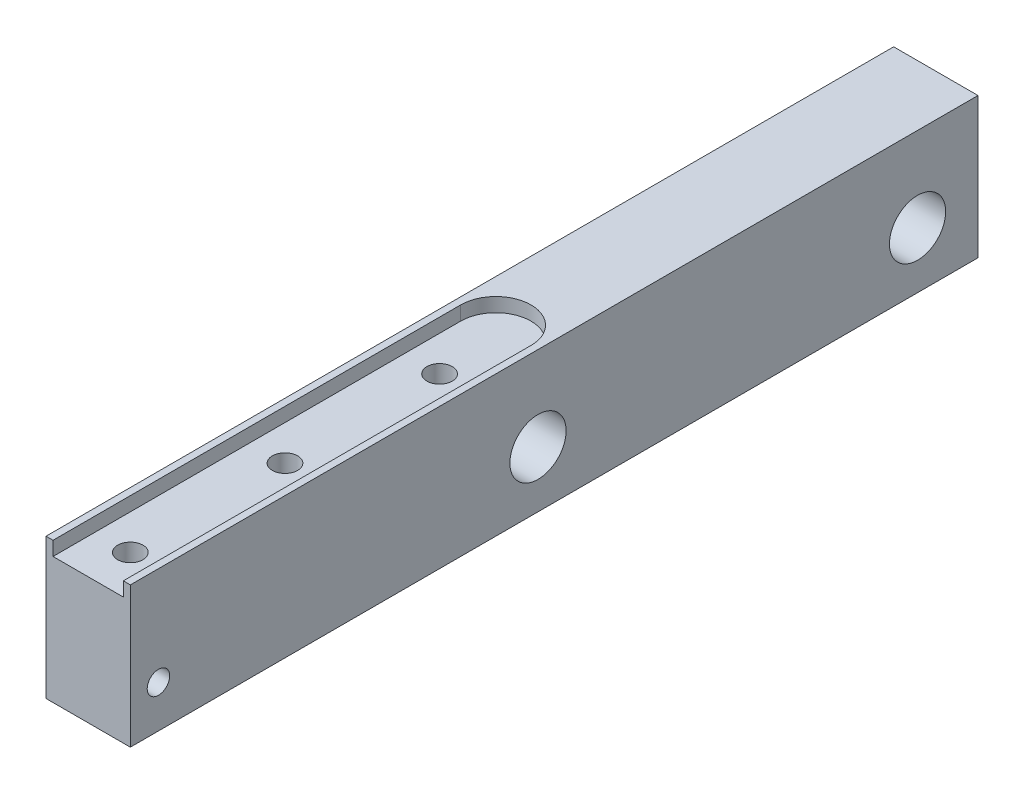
ISO-10303-21;
HEADER;
FILE_DESCRIPTION(('STEP AP214'),'2;1');
FILE_NAME('part.step','',(''),(''),'','','');
FILE_SCHEMA(('AUTOMOTIVE_DESIGN { 1 0 10303 214 1 1 1 1 }'));
ENDSEC;
DATA;
#1=APPLICATION_CONTEXT('core data for automotive mechanical design processes');
#2=APPLICATION_PROTOCOL_DEFINITION('international standard','automotive_design',2000,#1);
#3=PRODUCT_CONTEXT('',#1,'mechanical');
#4=PRODUCT('Part','Part','',(#3));
#5=PRODUCT_RELATED_PRODUCT_CATEGORY('part','',(#4));
#6=PRODUCT_DEFINITION_FORMATION('','',#4);
#7=PRODUCT_DEFINITION_CONTEXT('part definition',#1,'design');
#8=PRODUCT_DEFINITION('design','',#6,#7);
#9=PRODUCT_DEFINITION_SHAPE('','',#8);
#10=(LENGTH_UNIT() NAMED_UNIT(*) SI_UNIT(.MILLI.,.METRE.));
#11=(NAMED_UNIT(*) PLANE_ANGLE_UNIT() SI_UNIT($,.RADIAN.));
#12=(NAMED_UNIT(*) SI_UNIT($,.STERADIAN.) SOLID_ANGLE_UNIT());
#13=UNCERTAINTY_MEASURE_WITH_UNIT(LENGTH_MEASURE(1.E-05),#10,'distance_accuracy_value','');
#14=(GEOMETRIC_REPRESENTATION_CONTEXT(3) GLOBAL_UNCERTAINTY_ASSIGNED_CONTEXT((#13)) GLOBAL_UNIT_ASSIGNED_CONTEXT((#10,
#11,#12)) REPRESENTATION_CONTEXT('',''));
#15=CARTESIAN_POINT('',(0.,0.,0.));
#16=DIRECTION('',(0.,0.,1.));
#17=DIRECTION('',(1.,0.,0.));
#18=AXIS2_PLACEMENT_3D('',#15,#16,#17);
#19=CARTESIAN_POINT('',(0.,20.,156.5));
#20=DIRECTION('',(0.,1.,0.));
#21=DIRECTION('',(0.,0.,1.));
#22=AXIS2_PLACEMENT_3D('',#19,#20,#21);
#23=PLANE('',#22);
#24=CARTESIAN_POINT('',(0.,20.,231.5));
#25=DIRECTION('',(0.,1.,0.));
#26=DIRECTION('',(0.,0.,1.));
#27=AXIS2_PLACEMENT_3D('',#24,#25,#26);
#28=CIRCLE('',#27,4.49999999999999);
#29=CARTESIAN_POINT('',(0.,20.,236.));
#30=VERTEX_POINT('',#29);
#31=EDGE_CURVE('E135',#30,#30,#28,.F.);
#32=ORIENTED_EDGE('',*,*,#31,.T.);
#33=EDGE_LOOP('',(#32));
#34=FACE_BOUND('',#33,.T.);
#35=DIRECTION('',(0.,0.,1.));
#36=VECTOR('',#35,1.);
#37=CARTESIAN_POINT('',(-12.5,20.,301.5));
#38=LINE('',#37,#36);
#39=CARTESIAN_POINT('',(-12.5,20.,156.5));
#40=VERTEX_POINT('',#39);
#41=CARTESIAN_POINT('',(-12.5,20.,301.5));
#42=VERTEX_POINT('',#41);
#43=EDGE_CURVE('E45',#40,#42,#38,.T.);
#44=ORIENTED_EDGE('',*,*,#43,.T.);
#45=DIRECTION('',(1.,0.,0.));
#46=VECTOR('',#45,1.);
#47=CARTESIAN_POINT('',(-12.5,20.,301.5));
#48=LINE('',#47,#46);
#49=CARTESIAN_POINT('',(12.5,20.,301.5));
#50=VERTEX_POINT('',#49);
#51=EDGE_CURVE('E155',#42,#50,#48,.T.);
#52=ORIENTED_EDGE('',*,*,#51,.T.);
#53=DIRECTION('',(0.,0.,-1.));
#54=VECTOR('',#53,1.);
#55=CARTESIAN_POINT('',(12.5,20.,301.5));
#56=LINE('',#55,#54);
#57=CARTESIAN_POINT('',(12.5,20.,156.5));
#58=VERTEX_POINT('',#57);
#59=EDGE_CURVE('E157',#50,#58,#56,.T.);
#60=ORIENTED_EDGE('',*,*,#59,.T.);
#61=CARTESIAN_POINT('',(0.,20.,156.5));
#62=DIRECTION('',(0.,1.,0.));
#63=DIRECTION('',(0.,0.,1.));
#64=AXIS2_PLACEMENT_3D('',#61,#62,#63);
#65=CIRCLE('',#64,12.5);
#66=EDGE_CURVE('E160',#58,#40,#65,.T.);
#67=ORIENTED_EDGE('',*,*,#66,.T.);
#68=EDGE_LOOP('',(#44,#52,#60,#67));
#69=FACE_BOUND('',#68,.T.);
#70=CARTESIAN_POINT('',(0.,20.,176.5));
#71=DIRECTION('',(0.,1.,0.));
#72=DIRECTION('',(0.,0.,1.));
#73=AXIS2_PLACEMENT_3D('',#70,#71,#72);
#74=CIRCLE('',#73,4.49999999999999);
#75=CARTESIAN_POINT('',(0.,20.,181.));
#76=VERTEX_POINT('',#75);
#77=EDGE_CURVE('E139',#76,#76,#74,.F.);
#78=ORIENTED_EDGE('',*,*,#77,.T.);
#79=EDGE_LOOP('',(#78));
#80=FACE_BOUND('',#79,.T.);
#81=CARTESIAN_POINT('',(0.,20.,286.5));
#82=DIRECTION('',(0.,1.,0.));
#83=DIRECTION('',(0.,0.,1.));
#84=AXIS2_PLACEMENT_3D('',#81,#82,#83);
#85=CIRCLE('',#84,4.49999999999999);
#86=CARTESIAN_POINT('',(0.,20.,291.));
#87=VERTEX_POINT('',#86);
#88=EDGE_CURVE('E131',#87,#87,#85,.F.);
#89=ORIENTED_EDGE('',*,*,#88,.T.);
#90=EDGE_LOOP('',(#89));
#91=FACE_BOUND('',#90,.T.);
#92=ADVANCED_FACE('F28',(#34,#69,#80,#91),#23,.T.);
#93=CARTESIAN_POINT('',(-15.,25.,301.5));
#94=DIRECTION('',(1.,0.,0.));
#95=DIRECTION('',(0.,1.,0.));
#96=AXIS2_PLACEMENT_3D('',#93,#94,#95);
#97=PLANE('',#96);
#98=CARTESIAN_POINT('',(-15.,-10.,291.5));
#99=DIRECTION('',(1.,0.,0.));
#100=DIRECTION('',(0.,1.,0.));
#101=AXIS2_PLACEMENT_3D('',#98,#99,#100);
#102=CIRCLE('',#101,3.99999999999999);
#103=CARTESIAN_POINT('',(-15.,-6.00000000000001,291.5));
#104=VERTEX_POINT('',#103);
#105=EDGE_CURVE('E143',#104,#104,#102,.F.);
#106=ORIENTED_EDGE('',*,*,#105,.F.);
#107=EDGE_LOOP('',(#106));
#108=FACE_BOUND('',#107,.T.);
#109=CARTESIAN_POINT('',(-15.,-5.,21.5));
#110=DIRECTION('',(1.,0.,0.));
#111=DIRECTION('',(0.,1.,0.));
#112=AXIS2_PLACEMENT_3D('',#109,#110,#111);
#113=CIRCLE('',#112,10.);
#114=CARTESIAN_POINT('',(-15.,5.,21.5));
#115=VERTEX_POINT('',#114);
#116=EDGE_CURVE('E173',#115,#115,#113,.F.);
#117=ORIENTED_EDGE('',*,*,#116,.F.);
#118=EDGE_LOOP('',(#117));
#119=FACE_BOUND('',#118,.T.);
#120=CARTESIAN_POINT('',(-15.,-5.,156.5));
#121=DIRECTION('',(1.,0.,0.));
#122=DIRECTION('',(0.,1.,0.));
#123=AXIS2_PLACEMENT_3D('',#120,#121,#122);
#124=CIRCLE('',#123,10.);
#125=CARTESIAN_POINT('',(-15.,5.00000000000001,156.5));
#126=VERTEX_POINT('',#125);
#127=EDGE_CURVE('E179',#126,#126,#124,.F.);
#128=ORIENTED_EDGE('',*,*,#127,.F.);
#129=EDGE_LOOP('',(#128));
#130=FACE_BOUND('',#129,.T.);
#131=DIRECTION('',(0.,-1.,0.));
#132=VECTOR('',#131,1.);
#133=CARTESIAN_POINT('',(-15.,25.,0.));
#134=LINE('',#133,#132);
#135=CARTESIAN_POINT('',(-15.,25.,0.));
#136=VERTEX_POINT('',#135);
#137=CARTESIAN_POINT('',(-15.,-25.,0.));
#138=VERTEX_POINT('',#137);
#139=EDGE_CURVE('E182',#136,#138,#134,.T.);
#140=ORIENTED_EDGE('',*,*,#139,.T.);
#141=DIRECTION('',(0.,0.,-1.));
#142=VECTOR('',#141,1.);
#143=CARTESIAN_POINT('',(-15.,-25.,301.5));
#144=LINE('',#143,#142);
#145=CARTESIAN_POINT('',(-15.,-25.,301.5));
#146=VERTEX_POINT('',#145);
#147=EDGE_CURVE('E11',#146,#138,#144,.T.);
#148=ORIENTED_EDGE('',*,*,#147,.F.);
#149=DIRECTION('',(0.,-1.,0.));
#150=VECTOR('',#149,1.);
#151=CARTESIAN_POINT('',(-15.,25.,301.5));
#152=LINE('',#151,#150);
#153=CARTESIAN_POINT('',(-15.,25.,301.5));
#154=VERTEX_POINT('',#153);
#155=EDGE_CURVE('E191',#154,#146,#152,.T.);
#156=ORIENTED_EDGE('',*,*,#155,.F.);
#157=DIRECTION('',(0.,0.,-1.));
#158=VECTOR('',#157,1.);
#159=CARTESIAN_POINT('',(-15.,25.,301.5));
#160=LINE('',#159,#158);
#161=EDGE_CURVE('E200',#154,#136,#160,.T.);
#162=ORIENTED_EDGE('',*,*,#161,.T.);
#163=EDGE_LOOP('',(#140,#148,#156,#162));
#164=FACE_BOUND('',#163,.T.);
#165=ADVANCED_FACE('F30',(#108,#119,#130,#164),#97,.F.);
#166=CARTESIAN_POINT('',(-15.,-25.,301.5));
#167=DIRECTION('',(0.,1.,0.));
#168=DIRECTION('',(0.,0.,1.));
#169=AXIS2_PLACEMENT_3D('',#166,#167,#168);
#170=PLANE('',#169);
#171=CARTESIAN_POINT('',(0.,-25.,201.5));
#172=DIRECTION('',(0.,1.,0.));
#173=DIRECTION('',(0.,0.,1.));
#174=AXIS2_PLACEMENT_3D('',#171,#172,#173);
#175=CIRCLE('',#174,2.50000000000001);
#176=CARTESIAN_POINT('',(0.,-25.,204.));
#177=VERTEX_POINT('',#176);
#178=EDGE_CURVE('E32',#177,#177,#175,.T.);
#179=ORIENTED_EDGE('',*,*,#178,.T.);
#180=EDGE_LOOP('',(#179));
#181=FACE_BOUND('',#180,.T.);
#182=CARTESIAN_POINT('',(0.,-25.,51.5));
#183=DIRECTION('',(0.,1.,0.));
#184=DIRECTION('',(0.,0.,1.));
#185=AXIS2_PLACEMENT_3D('',#182,#183,#184);
#186=CIRCLE('',#185,2.50000000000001);
#187=CARTESIAN_POINT('',(0.,-25.,54.));
#188=VERTEX_POINT('',#187);
#189=EDGE_CURVE('E127',#188,#188,#186,.T.);
#190=ORIENTED_EDGE('',*,*,#189,.T.);
#191=EDGE_LOOP('',(#190));
#192=FACE_BOUND('',#191,.T.);
#193=DIRECTION('',(1.,0.,0.));
#194=VECTOR('',#193,1.);
#195=CARTESIAN_POINT('',(-15.,-25.,0.));
#196=LINE('',#195,#194);
#197=CARTESIAN_POINT('',(15.,-25.,0.));
#198=VERTEX_POINT('',#197);
#199=EDGE_CURVE('E185',#138,#198,#196,.T.);
#200=ORIENTED_EDGE('',*,*,#199,.T.);
#201=DIRECTION('',(0.,0.,-1.));
#202=VECTOR('',#201,1.);
#203=CARTESIAN_POINT('',(15.,-25.,301.5));
#204=LINE('',#203,#202);
#205=CARTESIAN_POINT('',(15.,-25.,301.5));
#206=VERTEX_POINT('',#205);
#207=EDGE_CURVE('E37',#206,#198,#204,.T.);
#208=ORIENTED_EDGE('',*,*,#207,.F.);
#209=DIRECTION('',(1.,0.,0.));
#210=VECTOR('',#209,1.);
#211=CARTESIAN_POINT('',(-15.,-25.,301.5));
#212=LINE('',#211,#210);
#213=EDGE_CURVE('E193',#146,#206,#212,.T.);
#214=ORIENTED_EDGE('',*,*,#213,.F.);
#215=ORIENTED_EDGE('',*,*,#147,.T.);
#216=EDGE_LOOP('',(#200,#208,#214,#215));
#217=FACE_BOUND('',#216,.T.);
#218=ADVANCED_FACE('F216',(#181,#192,#217),#170,.F.);
#219=CARTESIAN_POINT('',(15.,25.,301.5));
#220=DIRECTION('',(-1.,0.,0.));
#221=DIRECTION('',(0.,-1.,0.));
#222=AXIS2_PLACEMENT_3D('',#219,#220,#221);
#223=PLANE('',#222);
#224=CARTESIAN_POINT('',(15.,-10.,291.5));
#225=DIRECTION('',(1.,0.,0.));
#226=DIRECTION('',(0.,1.,0.));
#227=AXIS2_PLACEMENT_3D('',#224,#225,#226);
#228=CIRCLE('',#227,3.99999999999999);
#229=CARTESIAN_POINT('',(15.,-6.00000000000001,291.5));
#230=VERTEX_POINT('',#229);
#231=EDGE_CURVE('E140',#230,#230,#228,.T.);
#232=ORIENTED_EDGE('',*,*,#231,.F.);
#233=EDGE_LOOP('',(#232));
#234=FACE_BOUND('',#233,.T.);
#235=CARTESIAN_POINT('',(15.,-5.,21.5));
#236=DIRECTION('',(1.,0.,0.));
#237=DIRECTION('',(0.,1.,0.));
#238=AXIS2_PLACEMENT_3D('',#235,#236,#237);
#239=CIRCLE('',#238,10.);
#240=CARTESIAN_POINT('',(15.,5.,21.5));
#241=VERTEX_POINT('',#240);
#242=EDGE_CURVE('E165',#241,#241,#239,.T.);
#243=ORIENTED_EDGE('',*,*,#242,.F.);
#244=EDGE_LOOP('',(#243));
#245=FACE_BOUND('',#244,.T.);
#246=CARTESIAN_POINT('',(15.,-5.,156.5));
#247=DIRECTION('',(1.,0.,0.));
#248=DIRECTION('',(0.,1.,0.));
#249=AXIS2_PLACEMENT_3D('',#246,#247,#248);
#250=CIRCLE('',#249,10.);
#251=CARTESIAN_POINT('',(15.,5.00000000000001,156.5));
#252=VERTEX_POINT('',#251);
#253=EDGE_CURVE('E176',#252,#252,#250,.T.);
#254=ORIENTED_EDGE('',*,*,#253,.F.);
#255=EDGE_LOOP('',(#254));
#256=FACE_BOUND('',#255,.T.);
#257=DIRECTION('',(0.,1.,0.));
#258=VECTOR('',#257,1.);
#259=CARTESIAN_POINT('',(15.,25.,0.));
#260=LINE('',#259,#258);
#261=CARTESIAN_POINT('',(15.,25.,0.));
#262=VERTEX_POINT('',#261);
#263=EDGE_CURVE('E187',#198,#262,#260,.T.);
#264=ORIENTED_EDGE('',*,*,#263,.T.);
#265=DIRECTION('',(0.,0.,-1.));
#266=VECTOR('',#265,1.);
#267=CARTESIAN_POINT('',(15.,25.,301.5));
#268=LINE('',#267,#266);
#269=CARTESIAN_POINT('',(15.,25.,301.5));
#270=VERTEX_POINT('',#269);
#271=EDGE_CURVE('E203',#270,#262,#268,.T.);
#272=ORIENTED_EDGE('',*,*,#271,.F.);
#273=DIRECTION('',(0.,1.,0.));
#274=VECTOR('',#273,1.);
#275=CARTESIAN_POINT('',(15.,25.,301.5));
#276=LINE('',#275,#274);
#277=EDGE_CURVE('E195',#206,#270,#276,.T.);
#278=ORIENTED_EDGE('',*,*,#277,.F.);
#279=ORIENTED_EDGE('',*,*,#207,.T.);
#280=EDGE_LOOP('',(#264,#272,#278,#279));
#281=FACE_BOUND('',#280,.T.);
#282=ADVANCED_FACE('F278',(#234,#245,#256,#281),#223,.F.);
#283=CARTESIAN_POINT('',(-15.,25.,301.5));
#284=DIRECTION('',(0.,-1.,0.));
#285=DIRECTION('',(0.,0.,-1.));
#286=AXIS2_PLACEMENT_3D('',#283,#284,#285);
#287=PLANE('',#286);
#288=DIRECTION('',(-1.,0.,0.));
#289=VECTOR('',#288,1.);
#290=CARTESIAN_POINT('',(-15.,25.,301.5));
#291=LINE('',#290,#289);
#292=CARTESIAN_POINT('',(-12.5,25.,301.5));
#293=VERTEX_POINT('',#292);
#294=EDGE_CURVE('E53',#293,#154,#291,.T.);
#295=ORIENTED_EDGE('',*,*,#294,.F.);
#296=DIRECTION('',(0.,0.,1.));
#297=VECTOR('',#296,1.);
#298=CARTESIAN_POINT('',(-12.5,25.,301.5));
#299=LINE('',#298,#297);
#300=CARTESIAN_POINT('',(-12.5,25.,156.5));
#301=VERTEX_POINT('',#300);
#302=EDGE_CURVE('E146',#301,#293,#299,.T.);
#303=ORIENTED_EDGE('',*,*,#302,.F.);
#304=CARTESIAN_POINT('',(0.,25.,156.5));
#305=DIRECTION('',(0.,1.,0.));
#306=DIRECTION('',(0.,0.,1.));
#307=AXIS2_PLACEMENT_3D('',#304,#305,#306);
#308=CIRCLE('',#307,12.5);
#309=CARTESIAN_POINT('',(12.5,25.,156.5));
#310=VERTEX_POINT('',#309);
#311=EDGE_CURVE('E151',#310,#301,#308,.T.);
#312=ORIENTED_EDGE('',*,*,#311,.F.);
#313=DIRECTION('',(0.,0.,-1.));
#314=VECTOR('',#313,1.);
#315=CARTESIAN_POINT('',(12.5,25.,301.5));
#316=LINE('',#315,#314);
#317=CARTESIAN_POINT('',(12.5,25.,301.5));
#318=VERTEX_POINT('',#317);
#319=EDGE_CURVE('E148',#318,#310,#316,.T.);
#320=ORIENTED_EDGE('',*,*,#319,.F.);
#321=EDGE_CURVE('E197',#270,#318,#291,.T.);
#322=ORIENTED_EDGE('',*,*,#321,.F.);
#323=ORIENTED_EDGE('',*,*,#271,.T.);
#324=DIRECTION('',(-1.,0.,0.));
#325=VECTOR('',#324,1.);
#326=CARTESIAN_POINT('',(-15.,25.,0.));
#327=LINE('',#326,#325);
#328=EDGE_CURVE('E189',#262,#136,#327,.T.);
#329=ORIENTED_EDGE('',*,*,#328,.T.);
#330=ORIENTED_EDGE('',*,*,#161,.F.);
#331=EDGE_LOOP('',(#295,#303,#312,#320,#322,#323,#329,#330));
#332=FACE_BOUND('',#331,.T.);
#333=ADVANCED_FACE('F275',(#332),#287,.F.);
#334=CARTESIAN_POINT('',(-15.,-25.,301.5));
#335=DIRECTION('',(0.,0.,1.));
#336=DIRECTION('',(1.,0.,0.));
#337=AXIS2_PLACEMENT_3D('',#334,#335,#336);
#338=PLANE('',#337);
#339=DIRECTION('',(0.,1.,0.));
#340=VECTOR('',#339,1.);
#341=CARTESIAN_POINT('',(-12.5,20.,301.5));
#342=LINE('',#341,#340);
#343=EDGE_CURVE('E162',#42,#293,#342,.T.);
#344=ORIENTED_EDGE('',*,*,#343,.T.);
#345=ORIENTED_EDGE('',*,*,#294,.T.);
#346=ORIENTED_EDGE('',*,*,#155,.T.);
#347=ORIENTED_EDGE('',*,*,#213,.T.);
#348=ORIENTED_EDGE('',*,*,#277,.T.);
#349=ORIENTED_EDGE('',*,*,#321,.T.);
#350=DIRECTION('',(0.,1.,0.));
#351=VECTOR('',#350,1.);
#352=CARTESIAN_POINT('',(12.5,20.,301.5));
#353=LINE('',#352,#351);
#354=EDGE_CURVE('E168',#50,#318,#353,.T.);
#355=ORIENTED_EDGE('',*,*,#354,.F.);
#356=ORIENTED_EDGE('',*,*,#51,.F.);
#357=EDGE_LOOP('',(#344,#345,#346,#347,#348,#349,#355,#356));
#358=FACE_BOUND('',#357,.T.);
#359=ADVANCED_FACE('F271',(#358),#338,.T.);
#360=CARTESIAN_POINT('',(-15.,-25.,0.));
#361=DIRECTION('',(0.,0.,1.));
#362=DIRECTION('',(1.,0.,0.));
#363=AXIS2_PLACEMENT_3D('',#360,#361,#362);
#364=PLANE('',#363);
#365=ORIENTED_EDGE('',*,*,#139,.F.);
#366=ORIENTED_EDGE('',*,*,#328,.F.);
#367=ORIENTED_EDGE('',*,*,#263,.F.);
#368=ORIENTED_EDGE('',*,*,#199,.F.);
#369=EDGE_LOOP('',(#365,#366,#367,#368));
#370=FACE_BOUND('',#369,.T.);
#371=ADVANCED_FACE('F267',(#370),#364,.F.);
#372=CARTESIAN_POINT('',(-15.001,-5.,156.5));
#373=DIRECTION('',(1.,0.,0.));
#374=DIRECTION('',(0.,1.,0.));
#375=AXIS2_PLACEMENT_3D('',#372,#373,#374);
#376=CYLINDRICAL_SURFACE('',#375,10.);
#377=CARTESIAN_POINT('',(15.,5.00000000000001,156.5));
#378=CARTESIAN_POINT('',(14.6875,5.00000000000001,156.5));
#379=CARTESIAN_POINT('',(14.375,5.00000000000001,156.5));
#380=CARTESIAN_POINT('',(13.75,5.00000000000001,156.5));
#381=CARTESIAN_POINT('',(13.4375,5.00000000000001,156.5));
#382=CARTESIAN_POINT('',(12.8125,5.00000000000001,156.5));
#383=CARTESIAN_POINT('',(12.5,5.00000000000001,156.5));
#384=CARTESIAN_POINT('',(11.875,5.00000000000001,156.5));
#385=CARTESIAN_POINT('',(11.5625,5.00000000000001,156.5));
#386=CARTESIAN_POINT('',(10.9375,5.00000000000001,156.5));
#387=CARTESIAN_POINT('',(10.625,5.00000000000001,156.5));
#388=CARTESIAN_POINT('',(10.,5.00000000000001,156.5));
#389=CARTESIAN_POINT('',(9.6875,5.00000000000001,156.5));
#390=CARTESIAN_POINT('',(9.0625,5.00000000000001,156.5));
#391=CARTESIAN_POINT('',(8.75,5.00000000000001,156.5));
#392=CARTESIAN_POINT('',(8.125,5.00000000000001,156.5));
#393=CARTESIAN_POINT('',(7.8125,5.00000000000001,156.5));
#394=CARTESIAN_POINT('',(7.1875,5.00000000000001,156.5));
#395=CARTESIAN_POINT('',(6.875,5.00000000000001,156.5));
#396=CARTESIAN_POINT('',(6.25,5.00000000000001,156.5));
#397=CARTESIAN_POINT('',(5.9375,5.00000000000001,156.5));
#398=CARTESIAN_POINT('',(5.3125,5.00000000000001,156.5));
#399=CARTESIAN_POINT('',(5.,5.00000000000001,156.5));
#400=CARTESIAN_POINT('',(4.375,5.00000000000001,156.5));
#401=CARTESIAN_POINT('',(4.06249999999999,5.00000000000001,156.5));
#402=CARTESIAN_POINT('',(3.4375,5.00000000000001,156.5));
#403=CARTESIAN_POINT('',(3.125,5.00000000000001,156.5));
#404=CARTESIAN_POINT('',(2.5,5.00000000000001,156.5));
#405=CARTESIAN_POINT('',(2.1875,5.00000000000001,156.5));
#406=CARTESIAN_POINT('',(1.5625,5.00000000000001,156.5));
#407=CARTESIAN_POINT('',(1.25,5.00000000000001,156.5));
#408=CARTESIAN_POINT('',(0.624999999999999,5.00000000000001,156.5));
#409=CARTESIAN_POINT('',(0.312499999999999,5.00000000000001,156.5));
#410=CARTESIAN_POINT('',(-0.312500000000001,5.00000000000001,156.5));
#411=CARTESIAN_POINT('',(-0.625000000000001,5.00000000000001,156.5));
#412=CARTESIAN_POINT('',(-1.25,5.00000000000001,156.5));
#413=CARTESIAN_POINT('',(-1.5625,5.00000000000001,156.5));
#414=CARTESIAN_POINT('',(-2.1875,5.00000000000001,156.5));
#415=CARTESIAN_POINT('',(-2.5,5.00000000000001,156.5));
#416=CARTESIAN_POINT('',(-3.125,5.00000000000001,156.5));
#417=CARTESIAN_POINT('',(-3.4375,5.00000000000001,156.5));
#418=CARTESIAN_POINT('',(-4.0625,5.00000000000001,156.5));
#419=CARTESIAN_POINT('',(-4.375,5.00000000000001,156.5));
#420=CARTESIAN_POINT('',(-5.,5.00000000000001,156.5));
#421=CARTESIAN_POINT('',(-5.3125,5.00000000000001,156.5));
#422=CARTESIAN_POINT('',(-5.9375,5.00000000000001,156.5));
#423=CARTESIAN_POINT('',(-6.25,5.00000000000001,156.5));
#424=CARTESIAN_POINT('',(-6.875,5.00000000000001,156.5));
#425=CARTESIAN_POINT('',(-7.1875,5.00000000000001,156.5));
#426=CARTESIAN_POINT('',(-7.8125,5.00000000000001,156.5));
#427=CARTESIAN_POINT('',(-8.125,5.00000000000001,156.5));
#428=CARTESIAN_POINT('',(-8.75,5.00000000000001,156.5));
#429=CARTESIAN_POINT('',(-9.0625,5.00000000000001,156.5));
#430=CARTESIAN_POINT('',(-9.6875,5.00000000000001,156.5));
#431=CARTESIAN_POINT('',(-10.,5.00000000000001,156.5));
#432=CARTESIAN_POINT('',(-10.625,5.00000000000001,156.5));
#433=CARTESIAN_POINT('',(-10.9375,5.00000000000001,156.5));
#434=CARTESIAN_POINT('',(-11.5625,5.00000000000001,156.5));
#435=CARTESIAN_POINT('',(-11.875,5.00000000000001,156.5));
#436=CARTESIAN_POINT('',(-12.5,5.00000000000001,156.5));
#437=CARTESIAN_POINT('',(-12.8125,5.00000000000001,156.5));
#438=CARTESIAN_POINT('',(-13.4375,5.00000000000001,156.5));
#439=CARTESIAN_POINT('',(-13.75,5.00000000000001,156.5));
#440=CARTESIAN_POINT('',(-14.375,5.00000000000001,156.5));
#441=CARTESIAN_POINT('',(-14.6875,5.00000000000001,156.5));
#442=CARTESIAN_POINT('',(-15.,5.00000000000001,156.5));
#443=B_SPLINE_CURVE_WITH_KNOTS('',3,(#377,#378,#379,#380,#381,#382,#383,#384,#385,#386,#387,
#388,#389,#390,#391,#392,#393,#394,#395,#396,#397,#398,#399,#400,#401,#402,#403,#404,#405,#406,
#407,#408,#409,#410,#411,#412,#413,#414,#415,#416,#417,#418,#419,#420,#421,#422,#423,#424,#425,
#426,#427,#428,#429,#430,#431,#432,#433,#434,#435,#436,#437,#438,#439,#440,#441,#442),
.UNSPECIFIED.,.F.,.F.,(4,2,2,2,2,2,2,2,2,2,2,2,2,2,2,2,2,2,2,2,2,2,2,2,2,2,2,2,2,2,2,2,4),(0.,
0.937500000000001,1.875,2.8125,3.75,4.6875,5.625,6.5625,7.5,8.4375,9.375,10.3125,11.25,12.1875,
13.125,14.0625,15.,15.9375,16.875,17.8125,18.75,19.6875,20.625,21.5625,22.5,23.4375,24.375,
25.3125,26.25,27.1875,28.125,29.0625,30.),.UNSPECIFIED.);
#444=EDGE_CURVE('BSEAM263',#252,#126,#443,.T.);
#445=ORIENTED_EDGE('',*,*,#253,.T.);
#446=ORIENTED_EDGE('',*,*,#127,.T.);
#447=ORIENTED_EDGE('',*,*,#444,.T.);
#448=ORIENTED_EDGE('',*,*,#444,.F.);
#449=EDGE_LOOP('',(#445,#447,#446,#448));
#450=FACE_BOUND('',#449,.T.);
#451=ADVANCED_FACE('F263',(#450),#376,.F.);
#452=CARTESIAN_POINT('',(-15.001,-5.,21.5));
#453=DIRECTION('',(1.,0.,0.));
#454=DIRECTION('',(0.,1.,0.));
#455=AXIS2_PLACEMENT_3D('',#452,#453,#454);
#456=CYLINDRICAL_SURFACE('',#455,10.);
#457=CARTESIAN_POINT('',(15.,5.,21.5));
#458=CARTESIAN_POINT('',(14.6875,5.,21.5));
#459=CARTESIAN_POINT('',(14.375,5.,21.5));
#460=CARTESIAN_POINT('',(13.75,5.,21.5));
#461=CARTESIAN_POINT('',(13.4375,5.,21.5));
#462=CARTESIAN_POINT('',(12.8125,5.,21.5));
#463=CARTESIAN_POINT('',(12.5,5.,21.5));
#464=CARTESIAN_POINT('',(11.875,5.,21.5));
#465=CARTESIAN_POINT('',(11.5625,5.,21.5));
#466=CARTESIAN_POINT('',(10.9375,5.,21.5));
#467=CARTESIAN_POINT('',(10.625,5.,21.5));
#468=CARTESIAN_POINT('',(10.,5.,21.5));
#469=CARTESIAN_POINT('',(9.6875,5.,21.5));
#470=CARTESIAN_POINT('',(9.0625,5.,21.5));
#471=CARTESIAN_POINT('',(8.75,5.,21.5));
#472=CARTESIAN_POINT('',(8.125,5.,21.5));
#473=CARTESIAN_POINT('',(7.8125,5.,21.5));
#474=CARTESIAN_POINT('',(7.1875,5.,21.5));
#475=CARTESIAN_POINT('',(6.875,5.,21.5));
#476=CARTESIAN_POINT('',(6.25,5.,21.5));
#477=CARTESIAN_POINT('',(5.9375,5.,21.5));
#478=CARTESIAN_POINT('',(5.3125,5.,21.5));
#479=CARTESIAN_POINT('',(5.,5.,21.5));
#480=CARTESIAN_POINT('',(4.375,5.,21.5));
#481=CARTESIAN_POINT('',(4.06249999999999,5.,21.5));
#482=CARTESIAN_POINT('',(3.4375,5.,21.5));
#483=CARTESIAN_POINT('',(3.125,5.,21.5));
#484=CARTESIAN_POINT('',(2.5,5.,21.5));
#485=CARTESIAN_POINT('',(2.1875,5.,21.5));
#486=CARTESIAN_POINT('',(1.5625,5.,21.5));
#487=CARTESIAN_POINT('',(1.25,5.,21.5));
#488=CARTESIAN_POINT('',(0.624999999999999,5.,21.5));
#489=CARTESIAN_POINT('',(0.312499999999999,5.,21.5));
#490=CARTESIAN_POINT('',(-0.312500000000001,5.,21.5));
#491=CARTESIAN_POINT('',(-0.625000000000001,5.,21.5));
#492=CARTESIAN_POINT('',(-1.25,5.,21.5));
#493=CARTESIAN_POINT('',(-1.5625,5.,21.5));
#494=CARTESIAN_POINT('',(-2.1875,5.,21.5));
#495=CARTESIAN_POINT('',(-2.5,5.,21.5));
#496=CARTESIAN_POINT('',(-3.125,5.,21.5));
#497=CARTESIAN_POINT('',(-3.4375,5.,21.5));
#498=CARTESIAN_POINT('',(-4.0625,5.,21.5));
#499=CARTESIAN_POINT('',(-4.375,5.,21.5));
#500=CARTESIAN_POINT('',(-5.,5.,21.5));
#501=CARTESIAN_POINT('',(-5.3125,5.,21.5));
#502=CARTESIAN_POINT('',(-5.9375,5.,21.5));
#503=CARTESIAN_POINT('',(-6.25,5.,21.5));
#504=CARTESIAN_POINT('',(-6.875,5.,21.5));
#505=CARTESIAN_POINT('',(-7.1875,5.,21.5));
#506=CARTESIAN_POINT('',(-7.8125,5.,21.5));
#507=CARTESIAN_POINT('',(-8.125,5.,21.5));
#508=CARTESIAN_POINT('',(-8.75,5.,21.5));
#509=CARTESIAN_POINT('',(-9.0625,5.,21.5));
#510=CARTESIAN_POINT('',(-9.6875,5.,21.5));
#511=CARTESIAN_POINT('',(-10.,5.,21.5));
#512=CARTESIAN_POINT('',(-10.625,5.,21.5));
#513=CARTESIAN_POINT('',(-10.9375,5.,21.5));
#514=CARTESIAN_POINT('',(-11.5625,5.,21.5));
#515=CARTESIAN_POINT('',(-11.875,5.,21.5));
#516=CARTESIAN_POINT('',(-12.5,5.,21.5));
#517=CARTESIAN_POINT('',(-12.8125,5.,21.5));
#518=CARTESIAN_POINT('',(-13.4375,5.,21.5));
#519=CARTESIAN_POINT('',(-13.75,5.,21.5));
#520=CARTESIAN_POINT('',(-14.375,5.,21.5));
#521=CARTESIAN_POINT('',(-14.6875,5.,21.5));
#522=CARTESIAN_POINT('',(-15.,5.,21.5));
#523=B_SPLINE_CURVE_WITH_KNOTS('',3,(#457,#458,#459,#460,#461,#462,#463,#464,#465,#466,#467,
#468,#469,#470,#471,#472,#473,#474,#475,#476,#477,#478,#479,#480,#481,#482,#483,#484,#485,#486,
#487,#488,#489,#490,#491,#492,#493,#494,#495,#496,#497,#498,#499,#500,#501,#502,#503,#504,#505,
#506,#507,#508,#509,#510,#511,#512,#513,#514,#515,#516,#517,#518,#519,#520,#521,#522),
.UNSPECIFIED.,.F.,.F.,(4,2,2,2,2,2,2,2,2,2,2,2,2,2,2,2,2,2,2,2,2,2,2,2,2,2,2,2,2,2,2,2,4),(0.,
0.937500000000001,1.875,2.8125,3.75,4.6875,5.625,6.5625,7.5,8.4375,9.375,10.3125,11.25,12.1875,
13.125,14.0625,15.,15.9375,16.875,17.8125,18.75,19.6875,20.625,21.5625,22.5,23.4375,24.375,
25.3125,26.25,27.1875,28.125,29.0625,30.),.UNSPECIFIED.);
#524=EDGE_CURVE('BSEAM259',#241,#115,#523,.T.);
#525=ORIENTED_EDGE('',*,*,#242,.T.);
#526=ORIENTED_EDGE('',*,*,#116,.T.);
#527=ORIENTED_EDGE('',*,*,#524,.T.);
#528=ORIENTED_EDGE('',*,*,#524,.F.);
#529=EDGE_LOOP('',(#525,#527,#526,#528));
#530=FACE_BOUND('',#529,.T.);
#531=ADVANCED_FACE('F259',(#530),#456,.F.);
#532=CARTESIAN_POINT('',(-12.5,20.,301.5));
#533=DIRECTION('',(-1.,0.,0.));
#534=DIRECTION('',(0.,0.,1.));
#535=AXIS2_PLACEMENT_3D('',#532,#533,#534);
#536=PLANE('',#535);
#537=ORIENTED_EDGE('',*,*,#302,.T.);
#538=ORIENTED_EDGE('',*,*,#343,.F.);
#539=ORIENTED_EDGE('',*,*,#43,.F.);
#540=DIRECTION('',(0.,1.,0.));
#541=VECTOR('',#540,1.);
#542=CARTESIAN_POINT('',(-12.5,20.,156.5));
#543=LINE('',#542,#541);
#544=EDGE_CURVE('E163',#40,#301,#543,.T.);
#545=ORIENTED_EDGE('',*,*,#544,.T.);
#546=EDGE_LOOP('',(#537,#538,#539,#545));
#547=FACE_BOUND('',#546,.T.);
#548=ADVANCED_FACE('F252',(#547),#536,.F.);
#549=CARTESIAN_POINT('',(0.,20.,156.5));
#550=DIRECTION('',(0.,1.,0.));
#551=DIRECTION('',(0.,0.,1.));
#552=AXIS2_PLACEMENT_3D('',#549,#550,#551);
#553=CYLINDRICAL_SURFACE('',#552,12.5);
#554=ORIENTED_EDGE('',*,*,#311,.T.);
#555=ORIENTED_EDGE('',*,*,#544,.F.);
#556=ORIENTED_EDGE('',*,*,#66,.F.);
#557=DIRECTION('',(0.,1.,0.));
#558=VECTOR('',#557,1.);
#559=CARTESIAN_POINT('',(12.5,20.,156.5));
#560=LINE('',#559,#558);
#561=EDGE_CURVE('E166',#58,#310,#560,.T.);
#562=ORIENTED_EDGE('',*,*,#561,.T.);
#563=EDGE_LOOP('',(#554,#555,#556,#562));
#564=FACE_BOUND('',#563,.T.);
#565=ADVANCED_FACE('F248',(#564),#553,.F.);
#566=CARTESIAN_POINT('',(12.5,20.,301.5));
#567=DIRECTION('',(1.,0.,0.));
#568=DIRECTION('',(0.,0.,-1.));
#569=AXIS2_PLACEMENT_3D('',#566,#567,#568);
#570=PLANE('',#569);
#571=ORIENTED_EDGE('',*,*,#319,.T.);
#572=ORIENTED_EDGE('',*,*,#561,.F.);
#573=ORIENTED_EDGE('',*,*,#59,.F.);
#574=ORIENTED_EDGE('',*,*,#354,.T.);
#575=EDGE_LOOP('',(#571,#572,#573,#574));
#576=FACE_BOUND('',#575,.T.);
#577=ADVANCED_FACE('F251',(#576),#570,.F.);
#578=CARTESIAN_POINT('',(-15.001,-10.,291.5));
#579=DIRECTION('',(1.,0.,0.));
#580=DIRECTION('',(0.,1.,0.));
#581=AXIS2_PLACEMENT_3D('',#578,#579,#580);
#582=CYLINDRICAL_SURFACE('',#581,3.99999999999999);
#583=ORIENTED_EDGE('',*,*,#231,.T.);
#584=EDGE_LOOP('',(#583));
#585=FACE_BOUND('',#584,.T.);
#586=ORIENTED_EDGE('',*,*,#105,.T.);
#587=EDGE_LOOP('',(#586));
#588=FACE_BOUND('',#587,.T.);
#589=ADVANCED_FACE('F246',(#585,#588),#582,.F.);
#590=CARTESIAN_POINT('',(0.,-7.59807621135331,176.5));
#591=DIRECTION('',(0.,1.,0.));
#592=DIRECTION('',(0.,0.,1.));
#593=AXIS2_PLACEMENT_3D('',#590,#591,#592);
#594=CONICAL_SURFACE('',#593,0.,1.04719755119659);
#595=CARTESIAN_POINT('',(0.,-5.,176.5));
#596=DIRECTION('',(0.,1.,0.));
#597=DIRECTION('',(0.,0.,1.));
#598=AXIS2_PLACEMENT_3D('',#595,#596,#597);
#599=CIRCLE('',#598,4.49999999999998);
#600=CARTESIAN_POINT('',(0.,-5.,181.));
#601=VERTEX_POINT('',#600);
#602=EDGE_CURVE('E136',#601,#601,#599,.T.);
#603=ORIENTED_EDGE('',*,*,#602,.T.);
#604=EDGE_LOOP('',(#603));
#605=FACE_BOUND('',#604,.T.);
#606=CARTESIAN_POINT('',(0.,-7.5980762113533,176.5));
#607=VERTEX_POINT('',#606);
#608=VERTEX_LOOP('',#607);
#609=FACE_BOUND('',#608,.T.);
#610=ADVANCED_FACE('F337',(#605,#609),#594,.F.);
#611=CARTESIAN_POINT('',(0.,36.5243055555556,176.5));
#612=DIRECTION('',(0.,1.,0.));
#613=DIRECTION('',(0.,0.,1.));
#614=AXIS2_PLACEMENT_3D('',#611,#612,#613);
#615=CYLINDRICAL_SURFACE('',#614,4.49999999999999);
#616=ORIENTED_EDGE('',*,*,#77,.F.);
#617=EDGE_LOOP('',(#616));
#618=FACE_BOUND('',#617,.T.);
#619=ORIENTED_EDGE('',*,*,#602,.F.);
#620=EDGE_LOOP('',(#619));
#621=FACE_BOUND('',#620,.T.);
#622=ADVANCED_FACE('F327',(#618,#621),#615,.F.);
#623=CARTESIAN_POINT('',(0.,-7.59807621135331,231.5));
#624=DIRECTION('',(0.,1.,0.));
#625=DIRECTION('',(0.,0.,1.));
#626=AXIS2_PLACEMENT_3D('',#623,#624,#625);
#627=CONICAL_SURFACE('',#626,0.,1.04719755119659);
#628=CARTESIAN_POINT('',(0.,-5.,231.5));
#629=DIRECTION('',(0.,1.,0.));
#630=DIRECTION('',(0.,0.,1.));
#631=AXIS2_PLACEMENT_3D('',#628,#629,#630);
#632=CIRCLE('',#631,4.49999999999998);
#633=CARTESIAN_POINT('',(0.,-5.,236.));
#634=VERTEX_POINT('',#633);
#635=EDGE_CURVE('E132',#634,#634,#632,.T.);
#636=ORIENTED_EDGE('',*,*,#635,.T.);
#637=EDGE_LOOP('',(#636));
#638=FACE_BOUND('',#637,.T.);
#639=CARTESIAN_POINT('',(0.,-7.5980762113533,231.5));
#640=VERTEX_POINT('',#639);
#641=VERTEX_LOOP('',#640);
#642=FACE_BOUND('',#641,.T.);
#643=ADVANCED_FACE('F321',(#638,#642),#627,.F.);
#644=CARTESIAN_POINT('',(0.,36.5243055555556,231.5));
#645=DIRECTION('',(0.,1.,0.));
#646=DIRECTION('',(0.,0.,1.));
#647=AXIS2_PLACEMENT_3D('',#644,#645,#646);
#648=CYLINDRICAL_SURFACE('',#647,4.49999999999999);
#649=ORIENTED_EDGE('',*,*,#31,.F.);
#650=EDGE_LOOP('',(#649));
#651=FACE_BOUND('',#650,.T.);
#652=ORIENTED_EDGE('',*,*,#635,.F.);
#653=EDGE_LOOP('',(#652));
#654=FACE_BOUND('',#653,.T.);
#655=ADVANCED_FACE('F313',(#651,#654),#648,.F.);
#656=CARTESIAN_POINT('',(0.,-7.59807621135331,286.5));
#657=DIRECTION('',(0.,1.,0.));
#658=DIRECTION('',(0.,0.,1.));
#659=AXIS2_PLACEMENT_3D('',#656,#657,#658);
#660=CONICAL_SURFACE('',#659,0.,1.04719755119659);
#661=CARTESIAN_POINT('',(0.,-5.,286.5));
#662=DIRECTION('',(0.,1.,0.));
#663=DIRECTION('',(0.,0.,1.));
#664=AXIS2_PLACEMENT_3D('',#661,#662,#663);
#665=CIRCLE('',#664,4.49999999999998);
#666=CARTESIAN_POINT('',(0.,-5.,291.));
#667=VERTEX_POINT('',#666);
#668=EDGE_CURVE('E128',#667,#667,#665,.T.);
#669=ORIENTED_EDGE('',*,*,#668,.T.);
#670=EDGE_LOOP('',(#669));
#671=FACE_BOUND('',#670,.T.);
#672=CARTESIAN_POINT('',(0.,-7.5980762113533,286.5));
#673=VERTEX_POINT('',#672);
#674=VERTEX_LOOP('',#673);
#675=FACE_BOUND('',#674,.T.);
#676=ADVANCED_FACE('F231',(#671,#675),#660,.F.);
#677=CARTESIAN_POINT('',(0.,36.5243055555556,286.5));
#678=DIRECTION('',(0.,1.,0.));
#679=DIRECTION('',(0.,0.,1.));
#680=AXIS2_PLACEMENT_3D('',#677,#678,#679);
#681=CYLINDRICAL_SURFACE('',#680,4.49999999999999);
#682=ORIENTED_EDGE('',*,*,#88,.F.);
#683=EDGE_LOOP('',(#682));
#684=FACE_BOUND('',#683,.T.);
#685=ORIENTED_EDGE('',*,*,#668,.F.);
#686=EDGE_LOOP('',(#685));
#687=FACE_BOUND('',#686,.T.);
#688=ADVANCED_FACE('F222',(#684,#687),#681,.F.);
#689=CARTESIAN_POINT('',(0.,-41.9555237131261,51.5));
#690=DIRECTION('',(0.,-1.,0.));
#691=DIRECTION('',(0.,0.,-1.));
#692=AXIS2_PLACEMENT_3D('',#689,#690,#691);
#693=CYLINDRICAL_SURFACE('',#692,2.50000000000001);
#694=CARTESIAN_POINT('',(0.,-10.,51.5));
#695=DIRECTION('',(0.,-1.,0.));
#696=DIRECTION('',(0.,0.,-1.));
#697=AXIS2_PLACEMENT_3D('',#694,#695,#696);
#698=CIRCLE('',#697,2.50000000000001);
#699=CARTESIAN_POINT('',(0.,-10.,49.));
#700=VERTEX_POINT('',#699);
#701=EDGE_CURVE('E123',#700,#700,#698,.T.);
#702=ORIENTED_EDGE('',*,*,#701,.F.);
#703=EDGE_LOOP('',(#702));
#704=FACE_BOUND('',#703,.T.);
#705=ORIENTED_EDGE('',*,*,#189,.F.);
#706=EDGE_LOOP('',(#705));
#707=FACE_BOUND('',#706,.T.);
#708=ADVANCED_FACE('F219',(#704,#707),#693,.F.);
#709=CARTESIAN_POINT('',(0.,-10.,51.5));
#710=DIRECTION('',(0.,-1.,0.));
#711=DIRECTION('',(0.,0.,-1.));
#712=AXIS2_PLACEMENT_3D('',#709,#710,#711);
#713=CONICAL_SURFACE('',#712,2.50000000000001,1.0471975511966);
#714=CARTESIAN_POINT('',(0.,-8.55662432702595,51.5));
#715=VERTEX_POINT('',#714);
#716=VERTEX_LOOP('',#715);
#717=FACE_BOUND('',#716,.T.);
#718=ORIENTED_EDGE('',*,*,#701,.T.);
#719=EDGE_LOOP('',(#718));
#720=FACE_BOUND('',#719,.T.);
#721=ADVANCED_FACE('F221',(#717,#720),#713,.F.);
#722=CARTESIAN_POINT('',(0.,-41.9555237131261,201.5));
#723=DIRECTION('',(0.,-1.,0.));
#724=DIRECTION('',(0.,0.,-1.));
#725=AXIS2_PLACEMENT_3D('',#722,#723,#724);
#726=CYLINDRICAL_SURFACE('',#725,2.50000000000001);
#727=CARTESIAN_POINT('',(0.,-10.,201.5));
#728=DIRECTION('',(0.,-1.,0.));
#729=DIRECTION('',(0.,0.,-1.));
#730=AXIS2_PLACEMENT_3D('',#727,#728,#729);
#731=CIRCLE('',#730,2.50000000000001);
#732=CARTESIAN_POINT('',(0.,-10.,199.));
#733=VERTEX_POINT('',#732);
#734=EDGE_CURVE('E119',#733,#733,#731,.T.);
#735=ORIENTED_EDGE('',*,*,#734,.F.);
#736=EDGE_LOOP('',(#735));
#737=FACE_BOUND('',#736,.T.);
#738=ORIENTED_EDGE('',*,*,#178,.F.);
#739=EDGE_LOOP('',(#738));
#740=FACE_BOUND('',#739,.T.);
#741=ADVANCED_FACE('F115',(#737,#740),#726,.F.);
#742=CARTESIAN_POINT('',(0.,-10.,201.5));
#743=DIRECTION('',(0.,-1.,0.));
#744=DIRECTION('',(0.,0.,-1.));
#745=AXIS2_PLACEMENT_3D('',#742,#743,#744);
#746=CONICAL_SURFACE('',#745,2.50000000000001,1.0471975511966);
#747=CARTESIAN_POINT('',(0.,-8.55662432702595,201.5));
#748=VERTEX_POINT('',#747);
#749=VERTEX_LOOP('',#748);
#750=FACE_BOUND('',#749,.T.);
#751=ORIENTED_EDGE('',*,*,#734,.T.);
#752=EDGE_LOOP('',(#751));
#753=FACE_BOUND('',#752,.T.);
#754=ADVANCED_FACE('F112',(#750,#753),#746,.F.);
#755=CLOSED_SHELL('',(#92,#165,#218,#282,#333,#359,#371,#451,#531,#548,#565,#577,#589,#610,#622,
#643,#655,#676,#688,#708,#721,#741,#754));
#756=MANIFOLD_SOLID_BREP('B2',#755);
#757=ADVANCED_BREP_SHAPE_REPRESENTATION('',(#18,#756),#14);
#758=SHAPE_DEFINITION_REPRESENTATION(#9,#757);
ENDSEC;
END-ISO-10303-21;
